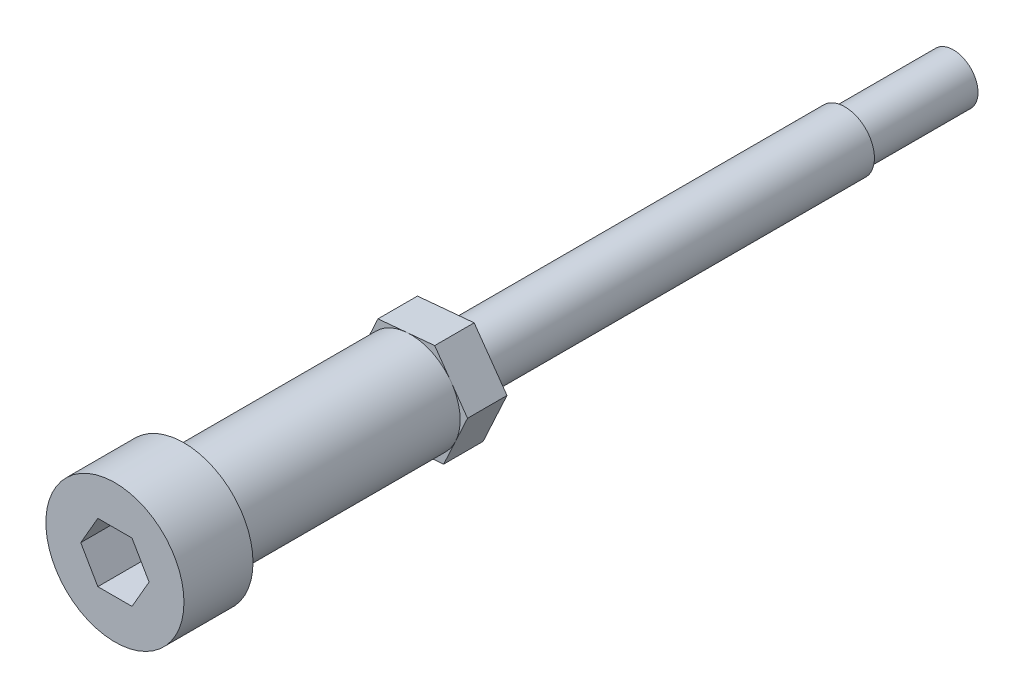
ISO-10303-21;
HEADER;
FILE_DESCRIPTION(('STEP AP214'),'2;1');
FILE_NAME('part.step','',(''),(''),'','','');
FILE_SCHEMA(('AUTOMOTIVE_DESIGN { 1 0 10303 214 1 1 1 1 }'));
ENDSEC;
DATA;
#1=APPLICATION_CONTEXT('core data for automotive mechanical design processes');
#2=APPLICATION_PROTOCOL_DEFINITION('international standard','automotive_design',2000,#1);
#3=PRODUCT_CONTEXT('',#1,'mechanical');
#4=PRODUCT('Part','Part','',(#3));
#5=PRODUCT_RELATED_PRODUCT_CATEGORY('part','',(#4));
#6=PRODUCT_DEFINITION_FORMATION('','',#4);
#7=PRODUCT_DEFINITION_CONTEXT('part definition',#1,'design');
#8=PRODUCT_DEFINITION('design','',#6,#7);
#9=PRODUCT_DEFINITION_SHAPE('','',#8);
#10=(LENGTH_UNIT() NAMED_UNIT(*) SI_UNIT(.MILLI.,.METRE.));
#11=(NAMED_UNIT(*) PLANE_ANGLE_UNIT() SI_UNIT($,.RADIAN.));
#12=(NAMED_UNIT(*) SI_UNIT($,.STERADIAN.) SOLID_ANGLE_UNIT());
#13=UNCERTAINTY_MEASURE_WITH_UNIT(LENGTH_MEASURE(1.E-05),#10,'distance_accuracy_value','');
#14=(GEOMETRIC_REPRESENTATION_CONTEXT(3) GLOBAL_UNCERTAINTY_ASSIGNED_CONTEXT((#13)) GLOBAL_UNIT_ASSIGNED_CONTEXT((#10,
#11,#12)) REPRESENTATION_CONTEXT('',''));
#15=CARTESIAN_POINT('',(0.,0.,0.));
#16=DIRECTION('',(0.,0.,1.));
#17=DIRECTION('',(1.,0.,0.));
#18=AXIS2_PLACEMENT_3D('',#15,#16,#17);
#19=CARTESIAN_POINT('',(0.,0.,0.));
#20=DIRECTION('',(0.,0.,-1.));
#21=DIRECTION('',(-1.,0.,0.));
#22=AXIS2_PLACEMENT_3D('',#19,#20,#21);
#23=PLANE('',#22);
#24=DIRECTION('',(-0.5,0.866025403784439,0.));
#25=VECTOR('',#24,1.);
#26=CARTESIAN_POINT('',(6.92820323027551,0.,0.));
#27=LINE('',#26,#25);
#28=CARTESIAN_POINT('',(6.92820323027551,0.,0.));
#29=VERTEX_POINT('',#28);
#30=CARTESIAN_POINT('',(3.46410161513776,6.,0.));
#31=VERTEX_POINT('',#30);
#32=EDGE_CURVE('E176',#29,#31,#27,.T.);
#33=ORIENTED_EDGE('',*,*,#32,.F.);
#34=DIRECTION('',(0.5,0.866025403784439,0.));
#35=VECTOR('',#34,1.);
#36=CARTESIAN_POINT('',(3.46410161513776,-6.,0.));
#37=LINE('',#36,#35);
#38=CARTESIAN_POINT('',(3.46410161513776,-6.,0.));
#39=VERTEX_POINT('',#38);
#40=EDGE_CURVE('E58',#39,#29,#37,.T.);
#41=ORIENTED_EDGE('',*,*,#40,.F.);
#42=DIRECTION('',(1.,0.,0.));
#43=VECTOR('',#42,1.);
#44=CARTESIAN_POINT('',(-3.46410161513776,-6.,0.));
#45=LINE('',#44,#43);
#46=CARTESIAN_POINT('',(-3.46410161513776,-6.,0.));
#47=VERTEX_POINT('',#46);
#48=EDGE_CURVE('E188',#47,#39,#45,.T.);
#49=ORIENTED_EDGE('',*,*,#48,.F.);
#50=DIRECTION('',(0.5,-0.866025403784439,0.));
#51=VECTOR('',#50,1.);
#52=CARTESIAN_POINT('',(-6.92820323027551,0.,0.));
#53=LINE('',#52,#51);
#54=CARTESIAN_POINT('',(-6.92820323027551,0.,0.));
#55=VERTEX_POINT('',#54);
#56=EDGE_CURVE('E185',#55,#47,#53,.T.);
#57=ORIENTED_EDGE('',*,*,#56,.F.);
#58=DIRECTION('',(-0.5,-0.866025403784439,0.));
#59=VECTOR('',#58,1.);
#60=CARTESIAN_POINT('',(-3.46410161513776,6.,0.));
#61=LINE('',#60,#59);
#62=CARTESIAN_POINT('',(-3.46410161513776,6.,0.));
#63=VERTEX_POINT('',#62);
#64=EDGE_CURVE('E182',#63,#55,#61,.T.);
#65=ORIENTED_EDGE('',*,*,#64,.F.);
#66=DIRECTION('',(-1.,0.,0.));
#67=VECTOR('',#66,1.);
#68=CARTESIAN_POINT('',(3.46410161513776,6.,0.));
#69=LINE('',#68,#67);
#70=EDGE_CURVE('E179',#31,#63,#69,.T.);
#71=ORIENTED_EDGE('',*,*,#70,.F.);
#72=EDGE_LOOP('',(#33,#41,#49,#57,#65,#71));
#73=FACE_BOUND('',#72,.T.);
#74=CARTESIAN_POINT('',(0.,0.,0.));
#75=DIRECTION('',(0.,0.,1.));
#76=DIRECTION('',(1.,0.,0.));
#77=AXIS2_PLACEMENT_3D('',#74,#75,#76);
#78=CIRCLE('',#77,14.);
#79=CARTESIAN_POINT('',(14.,0.,0.));
#80=VERTEX_POINT('',#79);
#81=EDGE_CURVE('E12',#80,#80,#78,.T.);
#82=ORIENTED_EDGE('',*,*,#81,.T.);
#83=EDGE_LOOP('',(#82));
#84=FACE_BOUND('',#83,.T.);
#85=ADVANCED_FACE('F36',(#73,#84),#23,.F.);
#86=CARTESIAN_POINT('',(0.,0.,67.));
#87=DIRECTION('',(0.,0.,1.));
#88=DIRECTION('',(1.,0.,0.));
#89=AXIS2_PLACEMENT_3D('',#86,#87,#88);
#90=CYLINDRICAL_SURFACE('',#89,14.);
#91=ORIENTED_EDGE('',*,*,#81,.F.);
#92=EDGE_LOOP('',(#91));
#93=FACE_BOUND('',#92,.T.);
#94=CARTESIAN_POINT('',(0.,0.,-14.));
#95=DIRECTION('',(0.,0.,1.));
#96=DIRECTION('',(1.,0.,0.));
#97=AXIS2_PLACEMENT_3D('',#94,#95,#96);
#98=CIRCLE('',#97,14.);
#99=CARTESIAN_POINT('',(14.,0.,-14.));
#100=VERTEX_POINT('',#99);
#101=EDGE_CURVE('E43',#100,#100,#98,.T.);
#102=ORIENTED_EDGE('',*,*,#101,.T.);
#103=EDGE_LOOP('',(#102));
#104=FACE_BOUND('',#103,.T.);
#105=ADVANCED_FACE('F240',(#93,#104),#90,.T.);
#106=CARTESIAN_POINT('',(0.,14.,-14.));
#107=DIRECTION('',(0.,0.,1.));
#108=DIRECTION('',(1.,0.,0.));
#109=AXIS2_PLACEMENT_3D('',#106,#107,#108);
#110=PLANE('',#109);
#111=ORIENTED_EDGE('',*,*,#101,.F.);
#112=EDGE_LOOP('',(#111));
#113=FACE_BOUND('',#112,.T.);
#114=CARTESIAN_POINT('',(0.,0.,-14.));
#115=DIRECTION('',(0.,0.,1.));
#116=DIRECTION('',(1.,0.,0.));
#117=AXIS2_PLACEMENT_3D('',#114,#115,#116);
#118=CIRCLE('',#117,10.);
#119=CARTESIAN_POINT('',(10.,0.,-14.));
#120=VERTEX_POINT('',#119);
#121=EDGE_CURVE('E233',#120,#120,#118,.T.);
#122=ORIENTED_EDGE('',*,*,#121,.T.);
#123=EDGE_LOOP('',(#122));
#124=FACE_BOUND('',#123,.T.);
#125=ADVANCED_FACE('F242',(#113,#124),#110,.F.);
#126=CARTESIAN_POINT('',(0.,0.,67.));
#127=DIRECTION('',(0.,0.,1.));
#128=DIRECTION('',(1.,0.,0.));
#129=AXIS2_PLACEMENT_3D('',#126,#127,#128);
#130=CYLINDRICAL_SURFACE('',#129,10.);
#131=ORIENTED_EDGE('',*,*,#121,.F.);
#132=EDGE_LOOP('',(#131));
#133=FACE_BOUND('',#132,.T.);
#134=CARTESIAN_POINT('',(0.,0.,-60.));
#135=DIRECTION('',(0.,0.,1.));
#136=DIRECTION('',(1.,0.,0.));
#137=AXIS2_PLACEMENT_3D('',#134,#135,#136);
#138=CIRCLE('',#137,10.);
#139=CARTESIAN_POINT('',(8.1689471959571,5.76786803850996,-60.));
#140=VERTEX_POINT('',#139);
#141=CARTESIAN_POINT('',(-0.910646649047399,9.95844981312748,-60.));
#142=VERTEX_POINT('',#141);
#143=EDGE_CURVE('E230',#140,#142,#138,.T.);
#144=ORIENTED_EDGE('',*,*,#143,.T.);
#145=CARTESIAN_POINT('',(0.,0.,-60.));
#146=DIRECTION('',(0.,0.,-1.));
#147=DIRECTION('',(-1.,0.,0.));
#148=AXIS2_PLACEMENT_3D('',#145,#146,#147);
#149=CIRCLE('',#148,10.);
#150=CARTESIAN_POINT('',(-9.0795938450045,4.19058177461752,-60.));
#151=VERTEX_POINT('',#150);
#152=EDGE_CURVE('E169',#151,#142,#149,.T.);
#153=ORIENTED_EDGE('',*,*,#152,.F.);
#154=CARTESIAN_POINT('',(-8.1689471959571,-5.76786803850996,-60.));
#155=VERTEX_POINT('',#154);
#156=EDGE_CURVE('E165',#155,#151,#149,.T.);
#157=ORIENTED_EDGE('',*,*,#156,.F.);
#158=CARTESIAN_POINT('',(0.910646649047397,-9.95844981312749,-60.));
#159=VERTEX_POINT('',#158);
#160=EDGE_CURVE('E156',#159,#155,#149,.T.);
#161=ORIENTED_EDGE('',*,*,#160,.F.);
#162=CARTESIAN_POINT('',(9.07959384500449,-4.19058177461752,-60.));
#163=VERTEX_POINT('',#162);
#164=EDGE_CURVE('E320',#163,#159,#149,.T.);
#165=ORIENTED_EDGE('',*,*,#164,.F.);
#166=EDGE_CURVE('E256',#140,#163,#149,.T.);
#167=ORIENTED_EDGE('',*,*,#166,.F.);
#168=EDGE_LOOP('',(#144,#153,#157,#161,#165,#167));
#169=FACE_BOUND('',#168,.T.);
#170=ADVANCED_FACE('F245',(#133,#169),#130,.T.);
#171=CARTESIAN_POINT('',(3.46410161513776,-6.,-10.));
#172=DIRECTION('',(0.866025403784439,-0.5,0.));
#173=DIRECTION('',(0.5,0.866025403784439,0.));
#174=AXIS2_PLACEMENT_3D('',#171,#172,#173);
#175=PLANE('',#174);
#176=ORIENTED_EDGE('',*,*,#40,.T.);
#177=DIRECTION('',(0.,0.,1.));
#178=VECTOR('',#177,1.);
#179=CARTESIAN_POINT('',(6.92820323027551,0.,-10.));
#180=LINE('',#179,#178);
#181=CARTESIAN_POINT('',(6.92820323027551,0.,-10.));
#182=VERTEX_POINT('',#181);
#183=EDGE_CURVE('E209',#182,#29,#180,.T.);
#184=ORIENTED_EDGE('',*,*,#183,.F.);
#185=DIRECTION('',(0.5,0.866025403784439,0.));
#186=VECTOR('',#185,1.);
#187=CARTESIAN_POINT('',(3.46410161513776,-6.,-10.));
#188=LINE('',#187,#186);
#189=CARTESIAN_POINT('',(3.46410161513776,-6.,-10.));
#190=VERTEX_POINT('',#189);
#191=EDGE_CURVE('E191',#190,#182,#188,.T.);
#192=ORIENTED_EDGE('',*,*,#191,.F.);
#193=DIRECTION('',(0.,0.,1.));
#194=VECTOR('',#193,1.);
#195=CARTESIAN_POINT('',(3.46410161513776,-6.,-10.));
#196=LINE('',#195,#194);
#197=EDGE_CURVE('E210',#190,#39,#196,.T.);
#198=ORIENTED_EDGE('',*,*,#197,.T.);
#199=EDGE_LOOP('',(#176,#184,#192,#198));
#200=FACE_BOUND('',#199,.T.);
#201=ADVANCED_FACE('F251',(#200),#175,.F.);
#202=CARTESIAN_POINT('',(-3.46410161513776,-6.,-10.));
#203=DIRECTION('',(0.,-1.,0.));
#204=DIRECTION('',(1.,0.,0.));
#205=AXIS2_PLACEMENT_3D('',#202,#203,#204);
#206=PLANE('',#205);
#207=ORIENTED_EDGE('',*,*,#48,.T.);
#208=ORIENTED_EDGE('',*,*,#197,.F.);
#209=DIRECTION('',(1.,0.,0.));
#210=VECTOR('',#209,1.);
#211=CARTESIAN_POINT('',(-3.46410161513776,-6.,-10.));
#212=LINE('',#211,#210);
#213=CARTESIAN_POINT('',(-3.46410161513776,-6.,-10.));
#214=VERTEX_POINT('',#213);
#215=EDGE_CURVE('E206',#214,#190,#212,.T.);
#216=ORIENTED_EDGE('',*,*,#215,.F.);
#217=DIRECTION('',(0.,0.,1.));
#218=VECTOR('',#217,1.);
#219=CARTESIAN_POINT('',(-3.46410161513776,-6.,-10.));
#220=LINE('',#219,#218);
#221=EDGE_CURVE('E213',#214,#47,#220,.T.);
#222=ORIENTED_EDGE('',*,*,#221,.T.);
#223=EDGE_LOOP('',(#207,#208,#216,#222));
#224=FACE_BOUND('',#223,.T.);
#225=ADVANCED_FACE('F361',(#224),#206,.F.);
#226=CARTESIAN_POINT('',(-6.92820323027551,0.,-10.));
#227=DIRECTION('',(-0.866025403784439,-0.5,0.));
#228=DIRECTION('',(0.5,-0.866025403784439,0.));
#229=AXIS2_PLACEMENT_3D('',#226,#227,#228);
#230=PLANE('',#229);
#231=ORIENTED_EDGE('',*,*,#56,.T.);
#232=ORIENTED_EDGE('',*,*,#221,.F.);
#233=DIRECTION('',(0.5,-0.866025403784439,0.));
#234=VECTOR('',#233,1.);
#235=CARTESIAN_POINT('',(-6.92820323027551,0.,-10.));
#236=LINE('',#235,#234);
#237=CARTESIAN_POINT('',(-6.92820323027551,0.,-10.));
#238=VERTEX_POINT('',#237);
#239=EDGE_CURVE('E203',#238,#214,#236,.T.);
#240=ORIENTED_EDGE('',*,*,#239,.F.);
#241=DIRECTION('',(0.,0.,1.));
#242=VECTOR('',#241,1.);
#243=CARTESIAN_POINT('',(-6.92820323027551,0.,-10.));
#244=LINE('',#243,#242);
#245=EDGE_CURVE('E215',#238,#55,#244,.T.);
#246=ORIENTED_EDGE('',*,*,#245,.T.);
#247=EDGE_LOOP('',(#231,#232,#240,#246));
#248=FACE_BOUND('',#247,.T.);
#249=ADVANCED_FACE('F364',(#248),#230,.F.);
#250=CARTESIAN_POINT('',(-3.46410161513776,6.,-10.));
#251=DIRECTION('',(-0.866025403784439,0.5,0.));
#252=DIRECTION('',(-0.5,-0.866025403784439,0.));
#253=AXIS2_PLACEMENT_3D('',#250,#251,#252);
#254=PLANE('',#253);
#255=ORIENTED_EDGE('',*,*,#64,.T.);
#256=ORIENTED_EDGE('',*,*,#245,.F.);
#257=DIRECTION('',(-0.5,-0.866025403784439,0.));
#258=VECTOR('',#257,1.);
#259=CARTESIAN_POINT('',(-3.46410161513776,6.,-10.));
#260=LINE('',#259,#258);
#261=CARTESIAN_POINT('',(-3.46410161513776,6.,-10.));
#262=VERTEX_POINT('',#261);
#263=EDGE_CURVE('E200',#262,#238,#260,.T.);
#264=ORIENTED_EDGE('',*,*,#263,.F.);
#265=DIRECTION('',(0.,0.,1.));
#266=VECTOR('',#265,1.);
#267=CARTESIAN_POINT('',(-3.46410161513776,6.,-10.));
#268=LINE('',#267,#266);
#269=EDGE_CURVE('E217',#262,#63,#268,.T.);
#270=ORIENTED_EDGE('',*,*,#269,.T.);
#271=EDGE_LOOP('',(#255,#256,#264,#270));
#272=FACE_BOUND('',#271,.T.);
#273=ADVANCED_FACE('F367',(#272),#254,.F.);
#274=CARTESIAN_POINT('',(3.46410161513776,6.,-10.));
#275=DIRECTION('',(0.,1.,0.));
#276=DIRECTION('',(0.,0.,1.));
#277=AXIS2_PLACEMENT_3D('',#274,#275,#276);
#278=PLANE('',#277);
#279=ORIENTED_EDGE('',*,*,#70,.T.);
#280=ORIENTED_EDGE('',*,*,#269,.F.);
#281=DIRECTION('',(-1.,0.,0.));
#282=VECTOR('',#281,1.);
#283=CARTESIAN_POINT('',(3.46410161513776,6.,-10.));
#284=LINE('',#283,#282);
#285=CARTESIAN_POINT('',(3.46410161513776,6.,-10.));
#286=VERTEX_POINT('',#285);
#287=EDGE_CURVE('E197',#286,#262,#284,.T.);
#288=ORIENTED_EDGE('',*,*,#287,.F.);
#289=DIRECTION('',(0.,0.,1.));
#290=VECTOR('',#289,1.);
#291=CARTESIAN_POINT('',(3.46410161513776,6.,-10.));
#292=LINE('',#291,#290);
#293=EDGE_CURVE('E219',#286,#31,#292,.T.);
#294=ORIENTED_EDGE('',*,*,#293,.T.);
#295=EDGE_LOOP('',(#279,#280,#288,#294));
#296=FACE_BOUND('',#295,.T.);
#297=ADVANCED_FACE('F369',(#296),#278,.F.);
#298=CARTESIAN_POINT('',(6.92820323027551,0.,-10.));
#299=DIRECTION('',(0.866025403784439,0.5,0.));
#300=DIRECTION('',(-0.5,0.866025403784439,0.));
#301=AXIS2_PLACEMENT_3D('',#298,#299,#300);
#302=PLANE('',#301);
#303=ORIENTED_EDGE('',*,*,#32,.T.);
#304=ORIENTED_EDGE('',*,*,#293,.F.);
#305=DIRECTION('',(-0.5,0.866025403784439,0.));
#306=VECTOR('',#305,1.);
#307=CARTESIAN_POINT('',(6.92820323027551,0.,-10.));
#308=LINE('',#307,#306);
#309=EDGE_CURVE('E194',#182,#286,#308,.T.);
#310=ORIENTED_EDGE('',*,*,#309,.F.);
#311=ORIENTED_EDGE('',*,*,#183,.T.);
#312=EDGE_LOOP('',(#303,#304,#310,#311));
#313=FACE_BOUND('',#312,.T.);
#314=ADVANCED_FACE('F338',(#313),#302,.F.);
#315=CARTESIAN_POINT('',(3.46410161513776,-6.,-10.));
#316=DIRECTION('',(0.,0.,-1.));
#317=DIRECTION('',(-1.,0.,0.));
#318=AXIS2_PLACEMENT_3D('',#315,#316,#317);
#319=PLANE('',#318);
#320=ORIENTED_EDGE('',*,*,#191,.T.);
#321=ORIENTED_EDGE('',*,*,#309,.T.);
#322=ORIENTED_EDGE('',*,*,#287,.T.);
#323=ORIENTED_EDGE('',*,*,#263,.T.);
#324=ORIENTED_EDGE('',*,*,#239,.T.);
#325=ORIENTED_EDGE('',*,*,#215,.T.);
#326=EDGE_LOOP('',(#320,#321,#322,#323,#324,#325));
#327=FACE_BOUND('',#326,.T.);
#328=ADVANCED_FACE('F330',(#327),#319,.F.);
#329=CARTESIAN_POINT('',(-16.3378943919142,-11.5357360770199,-68.));
#330=DIRECTION('',(0.,0.,-1.));
#331=DIRECTION('',(-1.,0.,0.));
#332=AXIS2_PLACEMENT_3D('',#329,#330,#331);
#333=PLANE('',#332);
#334=DIRECTION('',(-0.995844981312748,-0.0910646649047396,0.));
#335=VECTOR('',#334,1.);
#336=CARTESIAN_POINT('',(6.66016032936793,-9.43268772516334,-68.));
#337=LINE('',#336,#335);
#338=CARTESIAN_POINT('',(6.66016032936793,-9.43268772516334,-68.));
#339=VERTEX_POINT('',#338);
#340=CARTESIAN_POINT('',(-4.83886703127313,-10.4842119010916,-68.));
#341=VERTEX_POINT('',#340);
#342=EDGE_CURVE('E288',#339,#341,#337,.T.);
#343=ORIENTED_EDGE('',*,*,#342,.T.);
#344=DIRECTION('',(-0.576786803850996,0.816894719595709,0.));
#345=VECTOR('',#344,1.);
#346=CARTESIAN_POINT('',(-4.83886703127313,-10.4842119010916,-68.));
#347=LINE('',#346,#345);
#348=CARTESIAN_POINT('',(-11.4990273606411,-1.05152417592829,-68.));
#349=VERTEX_POINT('',#348);
#350=EDGE_CURVE('E163',#341,#349,#347,.T.);
#351=ORIENTED_EDGE('',*,*,#350,.T.);
#352=DIRECTION('',(0.419058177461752,0.907959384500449,0.));
#353=VECTOR('',#352,1.);
#354=CARTESIAN_POINT('',(-11.4990273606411,-1.05152417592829,-68.));
#355=LINE('',#354,#353);
#356=CARTESIAN_POINT('',(-6.66016032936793,9.43268772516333,-68.));
#357=VERTEX_POINT('',#356);
#358=EDGE_CURVE('E291',#349,#357,#355,.T.);
#359=ORIENTED_EDGE('',*,*,#358,.T.);
#360=DIRECTION('',(0.995844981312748,0.0910646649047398,0.));
#361=VECTOR('',#360,1.);
#362=CARTESIAN_POINT('',(-6.66016032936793,9.43268772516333,-68.));
#363=LINE('',#362,#361);
#364=CARTESIAN_POINT('',(4.83886703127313,10.4842119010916,-68.));
#365=VERTEX_POINT('',#364);
#366=EDGE_CURVE('E293',#357,#365,#363,.T.);
#367=ORIENTED_EDGE('',*,*,#366,.T.);
#368=DIRECTION('',(0.576786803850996,-0.816894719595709,0.));
#369=VECTOR('',#368,1.);
#370=CARTESIAN_POINT('',(4.83886703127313,10.4842119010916,-68.));
#371=LINE('',#370,#369);
#372=CARTESIAN_POINT('',(11.4990273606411,1.05152417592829,-68.));
#373=VERTEX_POINT('',#372);
#374=EDGE_CURVE('E295',#365,#373,#371,.T.);
#375=ORIENTED_EDGE('',*,*,#374,.T.);
#376=DIRECTION('',(-0.419058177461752,-0.907959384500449,0.));
#377=VECTOR('',#376,1.);
#378=CARTESIAN_POINT('',(11.4990273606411,1.05152417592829,-68.));
#379=LINE('',#378,#377);
#380=EDGE_CURVE('E297',#373,#339,#379,.T.);
#381=ORIENTED_EDGE('',*,*,#380,.T.);
#382=EDGE_LOOP('',(#343,#351,#359,#367,#375,#381));
#383=FACE_BOUND('',#382,.T.);
#384=CARTESIAN_POINT('',(0.,0.,-68.));
#385=DIRECTION('',(0.,0.,-1.));
#386=DIRECTION('',(-1.,0.,0.));
#387=AXIS2_PLACEMENT_3D('',#384,#385,#386);
#388=CIRCLE('',#387,6.);
#389=CARTESIAN_POINT('',(-6.,0.,-68.));
#390=VERTEX_POINT('',#389);
#391=EDGE_CURVE('E39',#390,#390,#388,.T.);
#392=ORIENTED_EDGE('',*,*,#391,.F.);
#393=EDGE_LOOP('',(#392));
#394=FACE_BOUND('',#393,.T.);
#395=ADVANCED_FACE('F328',(#383,#394),#333,.T.);
#396=CARTESIAN_POINT('',(-16.3378943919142,-11.5357360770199,-60.));
#397=DIRECTION('',(0.,0.,-1.));
#398=DIRECTION('',(-1.,0.,0.));
#399=AXIS2_PLACEMENT_3D('',#396,#397,#398);
#400=PLANE('',#399);
#401=DIRECTION('',(0.419058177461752,0.907959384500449,0.));
#402=VECTOR('',#401,1.);
#403=CARTESIAN_POINT('',(-11.4990273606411,-1.05152417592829,-60.));
#404=LINE('',#403,#402);
#405=CARTESIAN_POINT('',(-6.66016032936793,9.43268772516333,-60.));
#406=VERTEX_POINT('',#405);
#407=EDGE_CURVE('E158',#151,#406,#404,.T.);
#408=ORIENTED_EDGE('',*,*,#407,.F.);
#409=ORIENTED_EDGE('',*,*,#152,.T.);
#410=DIRECTION('',(0.995844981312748,0.0910646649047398,0.));
#411=VECTOR('',#410,1.);
#412=CARTESIAN_POINT('',(-6.66016032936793,9.43268772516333,-60.));
#413=LINE('',#412,#411);
#414=EDGE_CURVE('E276',#406,#142,#413,.T.);
#415=ORIENTED_EDGE('',*,*,#414,.F.);
#416=EDGE_LOOP('',(#408,#409,#415));
#417=FACE_BOUND('',#416,.T.);
#418=ADVANCED_FACE('F313',(#417),#400,.F.);
#419=CARTESIAN_POINT('',(4.83886703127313,10.4842119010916,-60.));
#420=VERTEX_POINT('',#419);
#421=EDGE_CURVE('E264',#142,#420,#413,.T.);
#422=ORIENTED_EDGE('',*,*,#421,.F.);
#423=ORIENTED_EDGE('',*,*,#143,.F.);
#424=DIRECTION('',(0.576786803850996,-0.816894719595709,0.));
#425=VECTOR('',#424,1.);
#426=CARTESIAN_POINT('',(4.83886703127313,10.4842119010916,-60.));
#427=LINE('',#426,#425);
#428=EDGE_CURVE('E263',#420,#140,#427,.T.);
#429=ORIENTED_EDGE('',*,*,#428,.F.);
#430=EDGE_LOOP('',(#422,#423,#429));
#431=FACE_BOUND('',#430,.T.);
#432=ADVANCED_FACE('F261',(#431),#400,.F.);
#433=CARTESIAN_POINT('',(11.4990273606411,1.05152417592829,-60.));
#434=VERTEX_POINT('',#433);
#435=EDGE_CURVE('E268',#140,#434,#427,.T.);
#436=ORIENTED_EDGE('',*,*,#435,.F.);
#437=ORIENTED_EDGE('',*,*,#166,.T.);
#438=DIRECTION('',(-0.419058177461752,-0.907959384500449,0.));
#439=VECTOR('',#438,1.);
#440=CARTESIAN_POINT('',(11.4990273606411,1.05152417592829,-60.));
#441=LINE('',#440,#439);
#442=EDGE_CURVE('E272',#434,#163,#441,.T.);
#443=ORIENTED_EDGE('',*,*,#442,.F.);
#444=EDGE_LOOP('',(#436,#437,#443));
#445=FACE_BOUND('',#444,.T.);
#446=ADVANCED_FACE('F269',(#445),#400,.F.);
#447=CARTESIAN_POINT('',(6.66016032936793,-9.43268772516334,-60.));
#448=VERTEX_POINT('',#447);
#449=EDGE_CURVE('E283',#163,#448,#441,.T.);
#450=ORIENTED_EDGE('',*,*,#449,.F.);
#451=ORIENTED_EDGE('',*,*,#164,.T.);
#452=DIRECTION('',(-0.995844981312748,-0.0910646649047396,0.));
#453=VECTOR('',#452,1.);
#454=CARTESIAN_POINT('',(6.66016032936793,-9.43268772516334,-60.));
#455=LINE('',#454,#453);
#456=EDGE_CURVE('E150',#448,#159,#455,.T.);
#457=ORIENTED_EDGE('',*,*,#456,.F.);
#458=EDGE_LOOP('',(#450,#451,#457));
#459=FACE_BOUND('',#458,.T.);
#460=ADVANCED_FACE('F458',(#459),#400,.F.);
#461=CARTESIAN_POINT('',(-4.83886703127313,-10.4842119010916,-60.));
#462=VERTEX_POINT('',#461);
#463=EDGE_CURVE('E144',#159,#462,#455,.T.);
#464=ORIENTED_EDGE('',*,*,#463,.F.);
#465=ORIENTED_EDGE('',*,*,#160,.T.);
#466=DIRECTION('',(-0.576786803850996,0.816894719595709,0.));
#467=VECTOR('',#466,1.);
#468=CARTESIAN_POINT('',(-4.83886703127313,-10.4842119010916,-60.));
#469=LINE('',#468,#467);
#470=EDGE_CURVE('E50',#462,#155,#469,.T.);
#471=ORIENTED_EDGE('',*,*,#470,.F.);
#472=EDGE_LOOP('',(#464,#465,#471));
#473=FACE_BOUND('',#472,.T.);
#474=ADVANCED_FACE('F155',(#473),#400,.F.);
#475=CARTESIAN_POINT('',(-11.4990273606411,-1.05152417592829,-60.));
#476=VERTEX_POINT('',#475);
#477=EDGE_CURVE('E159',#155,#476,#469,.T.);
#478=ORIENTED_EDGE('',*,*,#477,.F.);
#479=ORIENTED_EDGE('',*,*,#156,.T.);
#480=EDGE_CURVE('E315',#476,#151,#404,.T.);
#481=ORIENTED_EDGE('',*,*,#480,.F.);
#482=EDGE_LOOP('',(#478,#479,#481));
#483=FACE_BOUND('',#482,.T.);
#484=ADVANCED_FACE('F319',(#483),#400,.F.);
#485=CARTESIAN_POINT('',(6.66016032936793,-9.43268772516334,-68.));
#486=DIRECTION('',(-0.0910646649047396,0.995844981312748,0.));
#487=DIRECTION('',(-0.995844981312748,-0.0910646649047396,0.));
#488=AXIS2_PLACEMENT_3D('',#485,#486,#487);
#489=PLANE('',#488);
#490=ORIENTED_EDGE('',*,*,#456,.T.);
#491=ORIENTED_EDGE('',*,*,#463,.T.);
#492=DIRECTION('',(0.,0.,1.));
#493=VECTOR('',#492,1.);
#494=CARTESIAN_POINT('',(-4.83886703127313,-10.4842119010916,-68.));
#495=LINE('',#494,#493);
#496=EDGE_CURVE('E147',#341,#462,#495,.T.);
#497=ORIENTED_EDGE('',*,*,#496,.F.);
#498=ORIENTED_EDGE('',*,*,#342,.F.);
#499=DIRECTION('',(0.,0.,1.));
#500=VECTOR('',#499,1.);
#501=CARTESIAN_POINT('',(6.66016032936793,-9.43268772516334,-68.));
#502=LINE('',#501,#500);
#503=EDGE_CURVE('E299',#339,#448,#502,.T.);
#504=ORIENTED_EDGE('',*,*,#503,.T.);
#505=EDGE_LOOP('',(#490,#491,#497,#498,#504));
#506=FACE_BOUND('',#505,.T.);
#507=ADVANCED_FACE('F145',(#506),#489,.F.);
#508=CARTESIAN_POINT('',(-4.83886703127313,-10.4842119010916,-68.));
#509=DIRECTION('',(0.816894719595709,0.576786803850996,0.));
#510=DIRECTION('',(-0.576786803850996,0.816894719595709,0.));
#511=AXIS2_PLACEMENT_3D('',#508,#509,#510);
#512=PLANE('',#511);
#513=ORIENTED_EDGE('',*,*,#470,.T.);
#514=ORIENTED_EDGE('',*,*,#477,.T.);
#515=DIRECTION('',(0.,0.,1.));
#516=VECTOR('',#515,1.);
#517=CARTESIAN_POINT('',(-11.4990273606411,-1.05152417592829,-68.));
#518=LINE('',#517,#516);
#519=EDGE_CURVE('E166',#349,#476,#518,.T.);
#520=ORIENTED_EDGE('',*,*,#519,.F.);
#521=ORIENTED_EDGE('',*,*,#350,.F.);
#522=ORIENTED_EDGE('',*,*,#496,.T.);
#523=EDGE_LOOP('',(#513,#514,#520,#521,#522));
#524=FACE_BOUND('',#523,.T.);
#525=ADVANCED_FACE('F161',(#524),#512,.F.);
#526=CARTESIAN_POINT('',(-11.4990273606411,-1.05152417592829,-68.));
#527=DIRECTION('',(0.907959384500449,-0.419058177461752,0.));
#528=DIRECTION('',(0.419058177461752,0.907959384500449,0.));
#529=AXIS2_PLACEMENT_3D('',#526,#527,#528);
#530=PLANE('',#529);
#531=ORIENTED_EDGE('',*,*,#480,.T.);
#532=ORIENTED_EDGE('',*,*,#407,.T.);
#533=DIRECTION('',(0.,0.,1.));
#534=VECTOR('',#533,1.);
#535=CARTESIAN_POINT('',(-6.66016032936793,9.43268772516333,-68.));
#536=LINE('',#535,#534);
#537=EDGE_CURVE('E171',#357,#406,#536,.T.);
#538=ORIENTED_EDGE('',*,*,#537,.F.);
#539=ORIENTED_EDGE('',*,*,#358,.F.);
#540=ORIENTED_EDGE('',*,*,#519,.T.);
#541=EDGE_LOOP('',(#531,#532,#538,#539,#540));
#542=FACE_BOUND('',#541,.T.);
#543=ADVANCED_FACE('F318',(#542),#530,.F.);
#544=CARTESIAN_POINT('',(-6.66016032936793,9.43268772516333,-68.));
#545=DIRECTION('',(0.0910646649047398,-0.995844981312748,0.));
#546=DIRECTION('',(0.995844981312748,0.0910646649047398,0.));
#547=AXIS2_PLACEMENT_3D('',#544,#545,#546);
#548=PLANE('',#547);
#549=ORIENTED_EDGE('',*,*,#414,.T.);
#550=ORIENTED_EDGE('',*,*,#421,.T.);
#551=DIRECTION('',(0.,0.,1.));
#552=VECTOR('',#551,1.);
#553=CARTESIAN_POINT('',(4.83886703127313,10.4842119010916,-68.));
#554=LINE('',#553,#552);
#555=EDGE_CURVE('E282',#365,#420,#554,.T.);
#556=ORIENTED_EDGE('',*,*,#555,.F.);
#557=ORIENTED_EDGE('',*,*,#366,.F.);
#558=ORIENTED_EDGE('',*,*,#537,.T.);
#559=EDGE_LOOP('',(#549,#550,#556,#557,#558));
#560=FACE_BOUND('',#559,.T.);
#561=ADVANCED_FACE('F308',(#560),#548,.F.);
#562=CARTESIAN_POINT('',(4.83886703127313,10.4842119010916,-68.));
#563=DIRECTION('',(-0.816894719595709,-0.576786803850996,0.));
#564=DIRECTION('',(0.576786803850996,-0.816894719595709,0.));
#565=AXIS2_PLACEMENT_3D('',#562,#563,#564);
#566=PLANE('',#565);
#567=ORIENTED_EDGE('',*,*,#428,.T.);
#568=ORIENTED_EDGE('',*,*,#435,.T.);
#569=DIRECTION('',(0.,0.,1.));
#570=VECTOR('',#569,1.);
#571=CARTESIAN_POINT('',(11.4990273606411,1.05152417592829,-68.));
#572=LINE('',#571,#570);
#573=EDGE_CURVE('E301',#373,#434,#572,.T.);
#574=ORIENTED_EDGE('',*,*,#573,.F.);
#575=ORIENTED_EDGE('',*,*,#374,.F.);
#576=ORIENTED_EDGE('',*,*,#555,.T.);
#577=EDGE_LOOP('',(#567,#568,#574,#575,#576));
#578=FACE_BOUND('',#577,.T.);
#579=ADVANCED_FACE('F279',(#578),#566,.F.);
#580=CARTESIAN_POINT('',(11.4990273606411,1.05152417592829,-68.));
#581=DIRECTION('',(-0.907959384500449,0.419058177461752,0.));
#582=DIRECTION('',(-0.419058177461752,-0.907959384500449,0.));
#583=AXIS2_PLACEMENT_3D('',#580,#581,#582);
#584=PLANE('',#583);
#585=ORIENTED_EDGE('',*,*,#442,.T.);
#586=ORIENTED_EDGE('',*,*,#449,.T.);
#587=ORIENTED_EDGE('',*,*,#503,.F.);
#588=ORIENTED_EDGE('',*,*,#380,.F.);
#589=ORIENTED_EDGE('',*,*,#573,.T.);
#590=EDGE_LOOP('',(#585,#586,#587,#588,#589));
#591=FACE_BOUND('',#590,.T.);
#592=ADVANCED_FACE('F386',(#591),#584,.F.);
#593=CARTESIAN_POINT('',(0.,5.,-170.));
#594=DIRECTION('',(0.,0.,1.));
#595=DIRECTION('',(1.,0.,0.));
#596=AXIS2_PLACEMENT_3D('',#593,#594,#595);
#597=PLANE('',#596);
#598=CARTESIAN_POINT('',(0.,0.,-170.));
#599=DIRECTION('',(0.,0.,1.));
#600=DIRECTION('',(1.,0.,0.));
#601=AXIS2_PLACEMENT_3D('',#598,#599,#600);
#602=CIRCLE('',#601,5.);
#603=CARTESIAN_POINT('',(5.,0.,-170.));
#604=VERTEX_POINT('',#603);
#605=EDGE_CURVE('E212',#604,#604,#602,.T.);
#606=ORIENTED_EDGE('',*,*,#605,.F.);
#607=EDGE_LOOP('',(#606));
#608=FACE_BOUND('',#607,.T.);
#609=ADVANCED_FACE('F382',(#608),#597,.F.);
#610=CARTESIAN_POINT('',(0.,0.,67.));
#611=DIRECTION('',(0.,0.,1.));
#612=DIRECTION('',(1.,0.,0.));
#613=AXIS2_PLACEMENT_3D('',#610,#611,#612);
#614=CYLINDRICAL_SURFACE('',#613,5.);
#615=CARTESIAN_POINT('',(0.,0.,-148.));
#616=DIRECTION('',(0.,0.,1.));
#617=DIRECTION('',(1.,0.,0.));
#618=AXIS2_PLACEMENT_3D('',#615,#616,#617);
#619=CIRCLE('',#618,5.);
#620=CARTESIAN_POINT('',(5.,0.,-148.));
#621=VERTEX_POINT('',#620);
#622=EDGE_CURVE('E224',#621,#621,#619,.T.);
#623=ORIENTED_EDGE('',*,*,#622,.F.);
#624=EDGE_LOOP('',(#623));
#625=FACE_BOUND('',#624,.T.);
#626=ORIENTED_EDGE('',*,*,#605,.T.);
#627=EDGE_LOOP('',(#626));
#628=FACE_BOUND('',#627,.T.);
#629=ADVANCED_FACE('F385',(#625,#628),#614,.T.);
#630=CARTESIAN_POINT('',(0.,6.,-148.));
#631=DIRECTION('',(0.,0.,1.));
#632=DIRECTION('',(1.,0.,0.));
#633=AXIS2_PLACEMENT_3D('',#630,#631,#632);
#634=PLANE('',#633);
#635=CARTESIAN_POINT('',(0.,0.,-148.));
#636=DIRECTION('',(0.,0.,1.));
#637=DIRECTION('',(1.,0.,0.));
#638=AXIS2_PLACEMENT_3D('',#635,#636,#637);
#639=CIRCLE('',#638,6.);
#640=CARTESIAN_POINT('',(6.,0.,-148.));
#641=VERTEX_POINT('',#640);
#642=EDGE_CURVE('E227',#641,#641,#639,.T.);
#643=ORIENTED_EDGE('',*,*,#642,.F.);
#644=EDGE_LOOP('',(#643));
#645=FACE_BOUND('',#644,.T.);
#646=ORIENTED_EDGE('',*,*,#622,.T.);
#647=EDGE_LOOP('',(#646));
#648=FACE_BOUND('',#647,.T.);
#649=ADVANCED_FACE('F390',(#645,#648),#634,.F.);
#650=CARTESIAN_POINT('',(0.,0.,67.));
#651=DIRECTION('',(0.,0.,1.));
#652=DIRECTION('',(1.,0.,0.));
#653=AXIS2_PLACEMENT_3D('',#650,#651,#652);
#654=CYLINDRICAL_SURFACE('',#653,6.);
#655=ORIENTED_EDGE('',*,*,#391,.T.);
#656=EDGE_LOOP('',(#655));
#657=FACE_BOUND('',#656,.T.);
#658=ORIENTED_EDGE('',*,*,#642,.T.);
#659=EDGE_LOOP('',(#658));
#660=FACE_BOUND('',#659,.T.);
#661=ADVANCED_FACE('F325',(#657,#660),#654,.T.);
#662=CLOSED_SHELL('',(#85,#105,#125,#170,#201,#225,#249,#273,#297,#314,#328,#395,#418,#432,#446,
#460,#474,#484,#507,#525,#543,#561,#579,#592,#609,#629,#649,#661));
#663=MANIFOLD_SOLID_BREP('B2',#662);
#664=ADVANCED_BREP_SHAPE_REPRESENTATION('',(#18,#663),#14);
#665=SHAPE_DEFINITION_REPRESENTATION(#9,#664);
ENDSEC;
END-ISO-10303-21;
